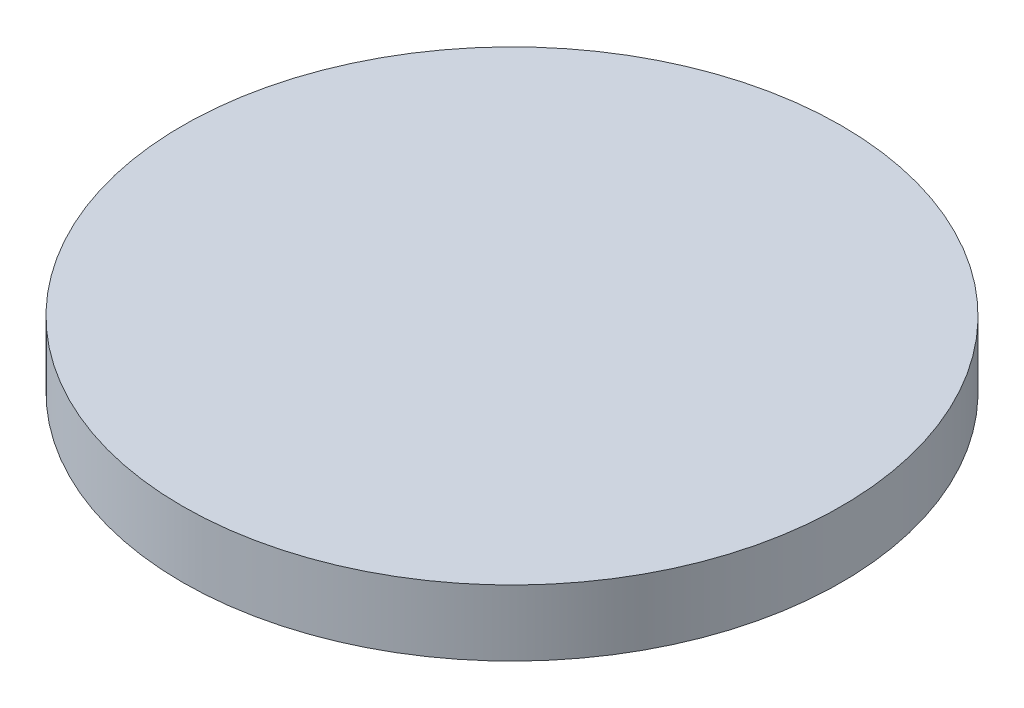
from build123d import *

# Parameters (mm, degrees)
SKETCH1_R           = 15
BOSS_EXTRUDE1_DEPTH = 3


with BuildPart() as part:
    # Sketch1 → Boss-Extrude1 (new body)
    with BuildSketch(Plane(origin=(0, 0, 0), x_dir=(1, 0, 0), z_dir=(0, 1, 0))):
        with Locations(Location((0, 0, 0), (0, 0, 270))):
            Circle(SKETCH1_R)
    extrude(amount=BOSS_EXTRUDE1_DEPTH)


solid = part.part
